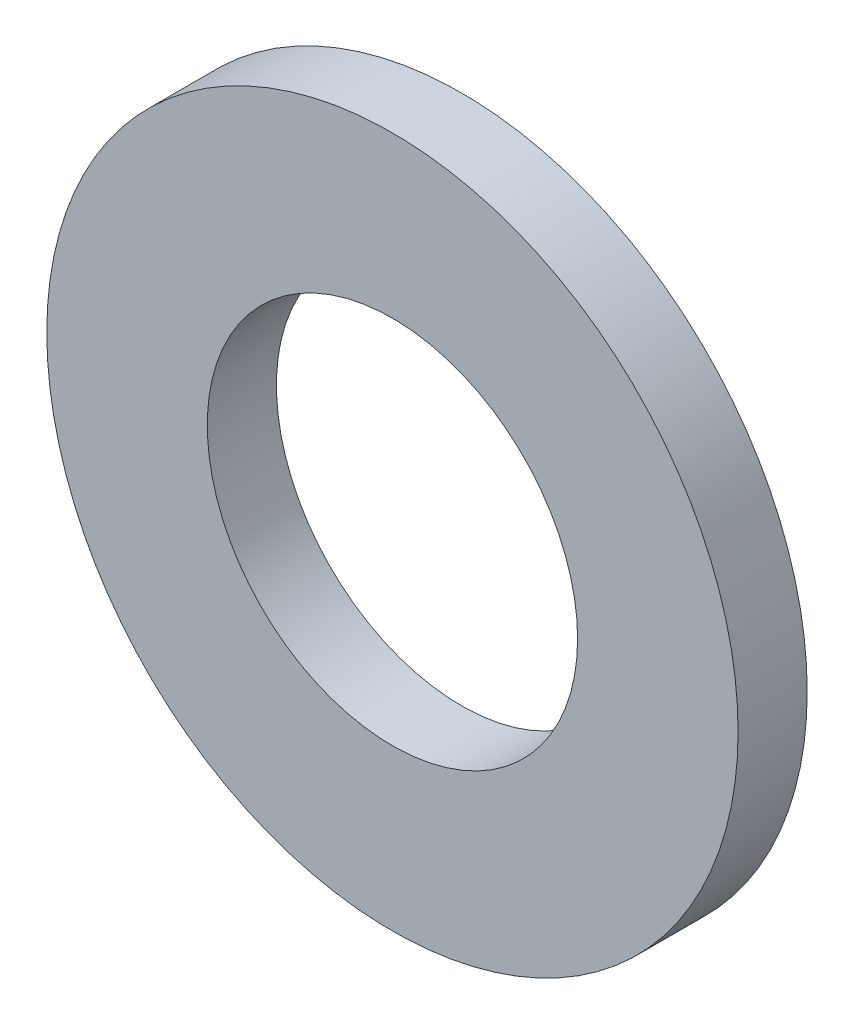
ISO-10303-21;
HEADER;
FILE_DESCRIPTION(('STEP AP214'),'2;1');
FILE_NAME('part.step','',(''),(''),'','','');
FILE_SCHEMA(('AUTOMOTIVE_DESIGN { 1 0 10303 214 1 1 1 1 }'));
ENDSEC;
DATA;
#1=APPLICATION_CONTEXT('core data for automotive mechanical design processes');
#2=APPLICATION_PROTOCOL_DEFINITION('international standard','automotive_design',2000,#1);
#3=PRODUCT_CONTEXT('',#1,'mechanical');
#4=PRODUCT('Part','Part','',(#3));
#5=PRODUCT_RELATED_PRODUCT_CATEGORY('part','',(#4));
#6=PRODUCT_DEFINITION_FORMATION('','',#4);
#7=PRODUCT_DEFINITION_CONTEXT('part definition',#1,'design');
#8=PRODUCT_DEFINITION('design','',#6,#7);
#9=PRODUCT_DEFINITION_SHAPE('','',#8);
#10=(LENGTH_UNIT() NAMED_UNIT(*) SI_UNIT(.MILLI.,.METRE.));
#11=(NAMED_UNIT(*) PLANE_ANGLE_UNIT() SI_UNIT($,.RADIAN.));
#12=(NAMED_UNIT(*) SI_UNIT($,.STERADIAN.) SOLID_ANGLE_UNIT());
#13=UNCERTAINTY_MEASURE_WITH_UNIT(LENGTH_MEASURE(1.E-05),#10,'distance_accuracy_value','');
#14=(GEOMETRIC_REPRESENTATION_CONTEXT(3) GLOBAL_UNCERTAINTY_ASSIGNED_CONTEXT((#13)) GLOBAL_UNIT_ASSIGNED_CONTEXT((#10,
#11,#12)) REPRESENTATION_CONTEXT('',''));
#15=CARTESIAN_POINT('',(0.,0.,0.));
#16=DIRECTION('',(0.,0.,1.));
#17=DIRECTION('',(1.,0.,0.));
#18=AXIS2_PLACEMENT_3D('',#15,#16,#17);
#19=CARTESIAN_POINT('',(0.,0.,-2.80000000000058));
#20=DIRECTION('',(0.,0.,0.999999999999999));
#21=DIRECTION('',(1.,0.,0.));
#22=AXIS2_PLACEMENT_3D('',#19,#20,#21);
#23=CYLINDRICAL_SURFACE('',#22,14.);
#24=CARTESIAN_POINT('',(0.,0.,-2.80000000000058));
#25=DIRECTION('',(0.,0.,0.999999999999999));
#26=DIRECTION('',(1.,0.,0.));
#27=AXIS2_PLACEMENT_3D('',#24,#25,#26);
#28=CIRCLE('',#27,14.);
#29=CARTESIAN_POINT('',(14.,0.,-2.80000000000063));
#30=VERTEX_POINT('',#29);
#31=EDGE_CURVE('E10',#30,#30,#28,.T.);
#32=CARTESIAN_POINT('',(0.,0.,-2.22044604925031E-13));
#33=DIRECTION('',(0.,0.,0.999999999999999));
#34=DIRECTION('',(1.,0.,0.));
#35=AXIS2_PLACEMENT_3D('',#32,#33,#34);
#36=CIRCLE('',#35,14.);
#37=CARTESIAN_POINT('',(14.,0.,-2.71917904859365E-13));
#38=VERTEX_POINT('',#37);
#39=EDGE_CURVE('E32',#38,#38,#36,.T.);
#40=CARTESIAN_POINT('',(14.,0.,-2.80000000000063));
#41=CARTESIAN_POINT('',(14.,0.,-2.77083333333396));
#42=CARTESIAN_POINT('',(14.,0.,-2.74166666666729));
#43=CARTESIAN_POINT('',(14.,0.,-2.68333333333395));
#44=CARTESIAN_POINT('',(14.,0.,-2.65416666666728));
#45=CARTESIAN_POINT('',(14.,0.,-2.59583333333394));
#46=CARTESIAN_POINT('',(14.,0.,-2.56666666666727));
#47=CARTESIAN_POINT('',(14.,0.,-2.50833333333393));
#48=CARTESIAN_POINT('',(14.,0.,-2.47916666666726));
#49=CARTESIAN_POINT('',(14.,0.,-2.42083333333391));
#50=CARTESIAN_POINT('',(14.,0.,-2.39166666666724));
#51=CARTESIAN_POINT('',(14.,0.,-2.3333333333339));
#52=CARTESIAN_POINT('',(14.,0.,-2.30416666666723));
#53=CARTESIAN_POINT('',(14.,0.,-2.24583333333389));
#54=CARTESIAN_POINT('',(14.,0.,-2.21666666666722));
#55=CARTESIAN_POINT('',(14.,0.,-2.15833333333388));
#56=CARTESIAN_POINT('',(14.,0.,-2.12916666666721));
#57=CARTESIAN_POINT('',(14.,0.,-2.07083333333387));
#58=CARTESIAN_POINT('',(14.,0.,-2.0416666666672));
#59=CARTESIAN_POINT('',(14.,0.,-1.98333333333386));
#60=CARTESIAN_POINT('',(14.,0.,-1.95416666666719));
#61=CARTESIAN_POINT('',(14.,0.,-1.89583333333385));
#62=CARTESIAN_POINT('',(14.,0.,-1.86666666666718));
#63=CARTESIAN_POINT('',(14.,0.,-1.80833333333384));
#64=CARTESIAN_POINT('',(14.,0.,-1.77916666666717));
#65=CARTESIAN_POINT('',(14.,0.,-1.72083333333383));
#66=CARTESIAN_POINT('',(14.,0.,-1.69166666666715));
#67=CARTESIAN_POINT('',(14.,0.,-1.63333333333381));
#68=CARTESIAN_POINT('',(14.,0.,-1.60416666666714));
#69=CARTESIAN_POINT('',(14.,0.,-1.5458333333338));
#70=CARTESIAN_POINT('',(14.,0.,-1.51666666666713));
#71=CARTESIAN_POINT('',(14.,0.,-1.45833333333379));
#72=CARTESIAN_POINT('',(14.,0.,-1.42916666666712));
#73=CARTESIAN_POINT('',(14.,0.,-1.37083333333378));
#74=CARTESIAN_POINT('',(14.,0.,-1.34166666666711));
#75=CARTESIAN_POINT('',(14.,0.,-1.28333333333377));
#76=CARTESIAN_POINT('',(14.,0.,-1.2541666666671));
#77=CARTESIAN_POINT('',(14.,0.,-1.19583333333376));
#78=CARTESIAN_POINT('',(14.,0.,-1.16666666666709));
#79=CARTESIAN_POINT('',(14.,0.,-1.10833333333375));
#80=CARTESIAN_POINT('',(14.,0.,-1.07916666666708));
#81=CARTESIAN_POINT('',(14.,0.,-1.02083333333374));
#82=CARTESIAN_POINT('',(14.,0.,-0.991666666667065));
#83=CARTESIAN_POINT('',(14.,0.,-0.933333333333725));
#84=CARTESIAN_POINT('',(14.,0.,-0.904166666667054));
#85=CARTESIAN_POINT('',(14.,0.,-0.845833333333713));
#86=CARTESIAN_POINT('',(14.,0.,-0.816666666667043));
#87=CARTESIAN_POINT('',(14.,0.,-0.758333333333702));
#88=CARTESIAN_POINT('',(14.,0.,-0.729166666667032));
#89=CARTESIAN_POINT('',(14.,0.,-0.670833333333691));
#90=CARTESIAN_POINT('',(14.,0.,-0.641666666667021));
#91=CARTESIAN_POINT('',(14.,0.,-0.58333333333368));
#92=CARTESIAN_POINT('',(14.,0.,-0.554166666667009));
#93=CARTESIAN_POINT('',(14.,0.,-0.495833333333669));
#94=CARTESIAN_POINT('',(14.,0.,-0.466666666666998));
#95=CARTESIAN_POINT('',(14.,0.,-0.408333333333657));
#96=CARTESIAN_POINT('',(14.,0.,-0.379166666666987));
#97=CARTESIAN_POINT('',(14.,0.,-0.320833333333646));
#98=CARTESIAN_POINT('',(14.,0.,-0.291666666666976));
#99=CARTESIAN_POINT('',(14.,0.,-0.233333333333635));
#100=CARTESIAN_POINT('',(14.,0.,-0.204166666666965));
#101=CARTESIAN_POINT('',(14.,0.,-0.145833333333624));
#102=CARTESIAN_POINT('',(14.,0.,-0.116666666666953));
#103=CARTESIAN_POINT('',(14.,0.,-0.0583333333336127));
#104=CARTESIAN_POINT('',(14.,0.,-0.0291666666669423));
#105=CARTESIAN_POINT('',(14.,0.,-2.71917904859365E-13));
#106=B_SPLINE_CURVE_WITH_KNOTS('',3,(#40,#41,#42,#43,#44,#45,#46,#47,#48,#49,#50,#51,#52,#53,
#54,#55,#56,#57,#58,#59,#60,#61,#62,#63,#64,#65,#66,#67,#68,#69,#70,#71,#72,#73,#74,#75,#76,#77,
#78,#79,#80,#81,#82,#83,#84,#85,#86,#87,#88,#89,#90,#91,#92,#93,#94,#95,#96,#97,#98,#99,#100,
#101,#102,#103,#104,#105),.UNSPECIFIED.,.F.,.F.,(4,2,2,2,2,2,2,2,2,2,2,2,2,2,2,2,2,2,2,2,2,2,2,
2,2,2,2,2,2,2,2,2,4),(0.,0.0875000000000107,0.175000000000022,0.262500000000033,
0.350000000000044,0.437500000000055,0.525000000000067,0.612500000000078,0.700000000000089,
0.7875000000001,0.875000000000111,0.962500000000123,1.05000000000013,1.13750000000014,
1.22500000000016,1.31250000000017,1.40000000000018,1.48750000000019,1.5750000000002,
1.66250000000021,1.75000000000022,1.83750000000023,1.92500000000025,2.01250000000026,
2.10000000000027,2.18750000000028,2.27500000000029,2.3625000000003,2.45000000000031,
2.53750000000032,2.62500000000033,2.71250000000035,2.80000000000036),.UNSPECIFIED.);
#107=EDGE_CURVE('BSEAM26',#30,#38,#106,.T.);
#108=ORIENTED_EDGE('',*,*,#31,.T.);
#109=ORIENTED_EDGE('',*,*,#39,.F.);
#110=ORIENTED_EDGE('',*,*,#107,.T.);
#111=ORIENTED_EDGE('',*,*,#107,.F.);
#112=EDGE_LOOP('',(#108,#110,#109,#111));
#113=FACE_BOUND('',#112,.T.);
#114=ADVANCED_FACE('F26',(#113),#23,.T.);
#115=CARTESIAN_POINT('',(0.,0.,-2.80000000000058));
#116=DIRECTION('',(0.,0.,0.999999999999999));
#117=DIRECTION('',(1.,0.,0.));
#118=AXIS2_PLACEMENT_3D('',#115,#116,#117);
#119=PLANE('',#118);
#120=CARTESIAN_POINT('',(0.,0.,-2.80000000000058));
#121=DIRECTION('',(0.,0.,0.999999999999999));
#122=DIRECTION('',(1.,0.,0.));
#123=AXIS2_PLACEMENT_3D('',#120,#121,#122);
#124=CIRCLE('',#123,7.5);
#125=CARTESIAN_POINT('',(7.50000000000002,0.,-2.80000000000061));
#126=VERTEX_POINT('',#125);
#127=EDGE_CURVE('E36',#126,#126,#124,.T.);
#128=ORIENTED_EDGE('',*,*,#127,.T.);
#129=EDGE_LOOP('',(#128));
#130=FACE_BOUND('',#129,.T.);
#131=ORIENTED_EDGE('',*,*,#31,.F.);
#132=EDGE_LOOP('',(#131));
#133=FACE_BOUND('',#132,.T.);
#134=ADVANCED_FACE('F50',(#130,#133),#119,.F.);
#135=CARTESIAN_POINT('',(0.,0.,-2.22044604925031E-13));
#136=DIRECTION('',(0.,0.,0.999999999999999));
#137=DIRECTION('',(1.,0.,0.));
#138=AXIS2_PLACEMENT_3D('',#135,#136,#137);
#139=PLANE('',#138);
#140=CARTESIAN_POINT('',(0.,0.,-2.22044604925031E-13));
#141=DIRECTION('',(0.,0.,0.999999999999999));
#142=DIRECTION('',(1.,0.,0.));
#143=AXIS2_PLACEMENT_3D('',#140,#141,#142);
#144=CIRCLE('',#143,7.5);
#145=CARTESIAN_POINT('',(7.50000000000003,0.,-2.48499137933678E-13));
#146=VERTEX_POINT('',#145);
#147=EDGE_CURVE('E40',#146,#146,#144,.T.);
#148=ORIENTED_EDGE('',*,*,#147,.F.);
#149=EDGE_LOOP('',(#148));
#150=FACE_BOUND('',#149,.T.);
#151=ORIENTED_EDGE('',*,*,#39,.T.);
#152=EDGE_LOOP('',(#151));
#153=FACE_BOUND('',#152,.T.);
#154=ADVANCED_FACE('F48',(#150,#153),#139,.T.);
#155=CARTESIAN_POINT('',(0.,0.,-2.80000000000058));
#156=DIRECTION('',(0.,0.,0.999999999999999));
#157=DIRECTION('',(1.,0.,0.));
#158=AXIS2_PLACEMENT_3D('',#155,#156,#157);
#159=CYLINDRICAL_SURFACE('',#158,7.5);
#160=CARTESIAN_POINT('',(7.50000000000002,0.,-2.80000000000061));
#161=CARTESIAN_POINT('',(7.50000000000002,0.,-2.77083333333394));
#162=CARTESIAN_POINT('',(7.50000000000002,0.,-2.74166666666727));
#163=CARTESIAN_POINT('',(7.50000000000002,0.,-2.68333333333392));
#164=CARTESIAN_POINT('',(7.50000000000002,0.,-2.65416666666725));
#165=CARTESIAN_POINT('',(7.50000000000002,0.,-2.59583333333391));
#166=CARTESIAN_POINT('',(7.50000000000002,0.,-2.56666666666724));
#167=CARTESIAN_POINT('',(7.50000000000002,0.,-2.5083333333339));
#168=CARTESIAN_POINT('',(7.50000000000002,0.,-2.47916666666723));
#169=CARTESIAN_POINT('',(7.50000000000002,0.,-2.42083333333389));
#170=CARTESIAN_POINT('',(7.50000000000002,0.,-2.39166666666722));
#171=CARTESIAN_POINT('',(7.50000000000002,0.,-2.33333333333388));
#172=CARTESIAN_POINT('',(7.50000000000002,0.,-2.30416666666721));
#173=CARTESIAN_POINT('',(7.50000000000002,0.,-2.24583333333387));
#174=CARTESIAN_POINT('',(7.50000000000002,0.,-2.2166666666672));
#175=CARTESIAN_POINT('',(7.50000000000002,0.,-2.15833333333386));
#176=CARTESIAN_POINT('',(7.50000000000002,0.,-2.12916666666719));
#177=CARTESIAN_POINT('',(7.50000000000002,0.,-2.07083333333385));
#178=CARTESIAN_POINT('',(7.50000000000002,0.,-2.04166666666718));
#179=CARTESIAN_POINT('',(7.50000000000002,0.,-1.98333333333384));
#180=CARTESIAN_POINT('',(7.50000000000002,0.,-1.95416666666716));
#181=CARTESIAN_POINT('',(7.50000000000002,0.,-1.89583333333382));
#182=CARTESIAN_POINT('',(7.50000000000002,0.,-1.86666666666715));
#183=CARTESIAN_POINT('',(7.50000000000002,0.,-1.80833333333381));
#184=CARTESIAN_POINT('',(7.50000000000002,0.,-1.77916666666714));
#185=CARTESIAN_POINT('',(7.50000000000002,0.,-1.7208333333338));
#186=CARTESIAN_POINT('',(7.50000000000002,0.,-1.69166666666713));
#187=CARTESIAN_POINT('',(7.50000000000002,0.,-1.63333333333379));
#188=CARTESIAN_POINT('',(7.50000000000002,0.,-1.60416666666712));
#189=CARTESIAN_POINT('',(7.50000000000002,0.,-1.54583333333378));
#190=CARTESIAN_POINT('',(7.50000000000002,0.,-1.51666666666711));
#191=CARTESIAN_POINT('',(7.50000000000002,0.,-1.45833333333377));
#192=CARTESIAN_POINT('',(7.50000000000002,0.,-1.4291666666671));
#193=CARTESIAN_POINT('',(7.50000000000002,0.,-1.37083333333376));
#194=CARTESIAN_POINT('',(7.50000000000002,0.,-1.34166666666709));
#195=CARTESIAN_POINT('',(7.50000000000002,0.,-1.28333333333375));
#196=CARTESIAN_POINT('',(7.50000000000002,0.,-1.25416666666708));
#197=CARTESIAN_POINT('',(7.50000000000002,0.,-1.19583333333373));
#198=CARTESIAN_POINT('',(7.50000000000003,0.,-1.16666666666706));
#199=CARTESIAN_POINT('',(7.50000000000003,0.,-1.10833333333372));
#200=CARTESIAN_POINT('',(7.50000000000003,0.,-1.07916666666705));
#201=CARTESIAN_POINT('',(7.50000000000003,0.,-1.02083333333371));
#202=CARTESIAN_POINT('',(7.50000000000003,0.,-0.991666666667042));
#203=CARTESIAN_POINT('',(7.50000000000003,0.,-0.933333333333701));
#204=CARTESIAN_POINT('',(7.50000000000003,0.,-0.904166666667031));
#205=CARTESIAN_POINT('',(7.50000000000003,0.,-0.84583333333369));
#206=CARTESIAN_POINT('',(7.50000000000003,0.,-0.816666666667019));
#207=CARTESIAN_POINT('',(7.50000000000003,0.,-0.758333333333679));
#208=CARTESIAN_POINT('',(7.50000000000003,0.,-0.729166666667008));
#209=CARTESIAN_POINT('',(7.50000000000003,0.,-0.670833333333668));
#210=CARTESIAN_POINT('',(7.50000000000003,0.,-0.641666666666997));
#211=CARTESIAN_POINT('',(7.50000000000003,0.,-0.583333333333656));
#212=CARTESIAN_POINT('',(7.50000000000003,0.,-0.554166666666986));
#213=CARTESIAN_POINT('',(7.50000000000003,0.,-0.495833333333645));
#214=CARTESIAN_POINT('',(7.50000000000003,0.,-0.466666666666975));
#215=CARTESIAN_POINT('',(7.50000000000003,0.,-0.408333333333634));
#216=CARTESIAN_POINT('',(7.50000000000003,0.,-0.379166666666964));
#217=CARTESIAN_POINT('',(7.50000000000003,0.,-0.320833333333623));
#218=CARTESIAN_POINT('',(7.50000000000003,0.,-0.291666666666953));
#219=CARTESIAN_POINT('',(7.50000000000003,0.,-0.233333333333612));
#220=CARTESIAN_POINT('',(7.50000000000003,0.,-0.204166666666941));
#221=CARTESIAN_POINT('',(7.50000000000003,0.,-0.1458333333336));
#222=CARTESIAN_POINT('',(7.50000000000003,0.,-0.11666666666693));
#223=CARTESIAN_POINT('',(7.50000000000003,0.,-0.0583333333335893));
#224=CARTESIAN_POINT('',(7.50000000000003,0.,-0.0291666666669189));
#225=CARTESIAN_POINT('',(7.50000000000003,0.,-2.48499137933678E-13));
#226=B_SPLINE_CURVE_WITH_KNOTS('',3,(#160,#161,#162,#163,#164,#165,#166,#167,#168,#169,#170,
#171,#172,#173,#174,#175,#176,#177,#178,#179,#180,#181,#182,#183,#184,#185,#186,#187,#188,#189,
#190,#191,#192,#193,#194,#195,#196,#197,#198,#199,#200,#201,#202,#203,#204,#205,#206,#207,#208,
#209,#210,#211,#212,#213,#214,#215,#216,#217,#218,#219,#220,#221,#222,#223,#224,#225),
.UNSPECIFIED.,.F.,.F.,(4,2,2,2,2,2,2,2,2,2,2,2,2,2,2,2,2,2,2,2,2,2,2,2,2,2,2,2,2,2,2,2,4),(0.,
0.0875000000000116,0.175000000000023,0.262500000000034,0.350000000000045,0.437500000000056,
0.525000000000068,0.612500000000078,0.70000000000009,0.787500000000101,0.875000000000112,
0.962500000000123,1.05000000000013,1.13750000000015,1.22500000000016,1.31250000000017,
1.40000000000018,1.48750000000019,1.5750000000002,1.66250000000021,1.75000000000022,
1.83750000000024,1.92500000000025,2.01250000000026,2.10000000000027,2.18750000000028,
2.27500000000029,2.3625000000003,2.45000000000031,2.53750000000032,2.62500000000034,
2.71250000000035,2.80000000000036),.UNSPECIFIED.);
#227=EDGE_CURVE('BSEAM46',#126,#146,#226,.T.);
#228=ORIENTED_EDGE('',*,*,#127,.F.);
#229=ORIENTED_EDGE('',*,*,#147,.T.);
#230=ORIENTED_EDGE('',*,*,#227,.T.);
#231=ORIENTED_EDGE('',*,*,#227,.F.);
#232=EDGE_LOOP('',(#228,#230,#229,#231));
#233=FACE_BOUND('',#232,.T.);
#234=ADVANCED_FACE('F46',(#233),#159,.F.);
#235=CLOSED_SHELL('',(#114,#134,#154,#234));
#236=MANIFOLD_SOLID_BREP('B2',#235);
#237=ADVANCED_BREP_SHAPE_REPRESENTATION('',(#18,#236),#14);
#238=SHAPE_DEFINITION_REPRESENTATION(#9,#237);
ENDSEC;
END-ISO-10303-21;
